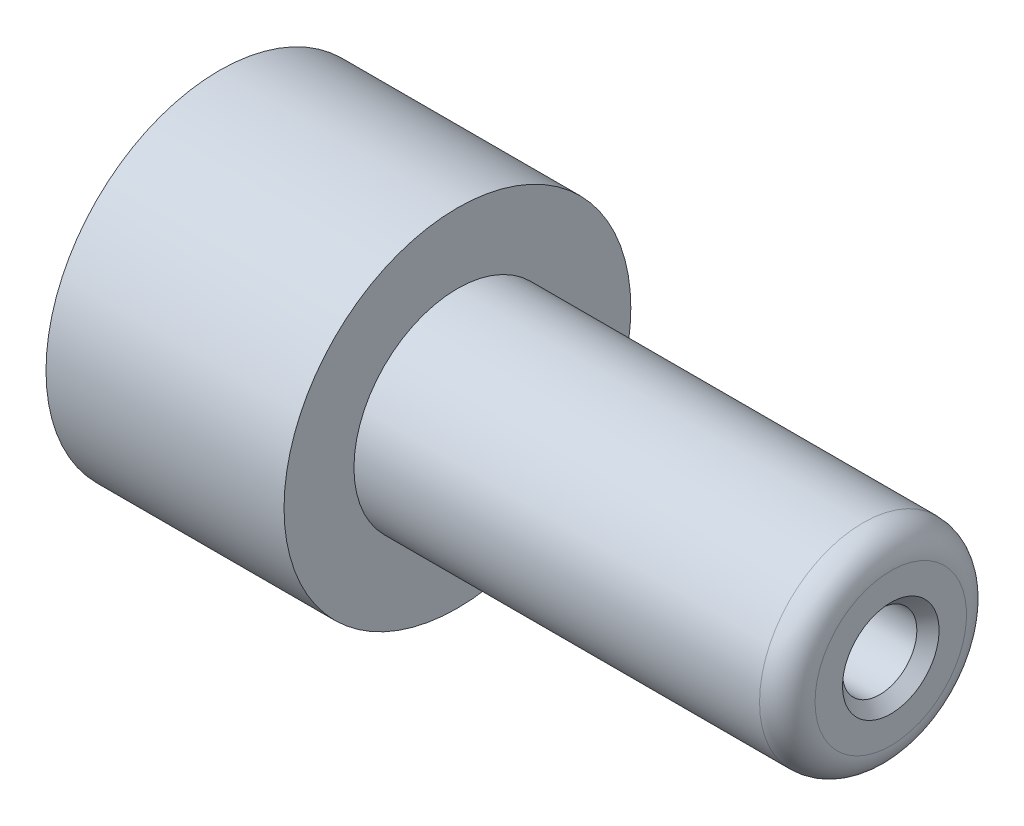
ISO-10303-21;
HEADER;
FILE_DESCRIPTION(('STEP AP214'),'2;1');
FILE_NAME('part.step','',(''),(''),'','','');
FILE_SCHEMA(('AUTOMOTIVE_DESIGN { 1 0 10303 214 1 1 1 1 }'));
ENDSEC;
DATA;
#1=APPLICATION_CONTEXT('core data for automotive mechanical design processes');
#2=APPLICATION_PROTOCOL_DEFINITION('international standard','automotive_design',2000,#1);
#3=PRODUCT_CONTEXT('',#1,'mechanical');
#4=PRODUCT('Part','Part','',(#3));
#5=PRODUCT_RELATED_PRODUCT_CATEGORY('part','',(#4));
#6=PRODUCT_DEFINITION_FORMATION('','',#4);
#7=PRODUCT_DEFINITION_CONTEXT('part definition',#1,'design');
#8=PRODUCT_DEFINITION('design','',#6,#7);
#9=PRODUCT_DEFINITION_SHAPE('','',#8);
#10=(LENGTH_UNIT() NAMED_UNIT(*) SI_UNIT(.MILLI.,.METRE.));
#11=(NAMED_UNIT(*) PLANE_ANGLE_UNIT() SI_UNIT($,.RADIAN.));
#12=(NAMED_UNIT(*) SI_UNIT($,.STERADIAN.) SOLID_ANGLE_UNIT());
#13=UNCERTAINTY_MEASURE_WITH_UNIT(LENGTH_MEASURE(1.E-05),#10,'distance_accuracy_value','');
#14=(GEOMETRIC_REPRESENTATION_CONTEXT(3) GLOBAL_UNCERTAINTY_ASSIGNED_CONTEXT((#13)) GLOBAL_UNIT_ASSIGNED_CONTEXT((#10,
#11,#12)) REPRESENTATION_CONTEXT('',''));
#15=CARTESIAN_POINT('',(0.,0.,0.));
#16=DIRECTION('',(0.,0.,1.));
#17=DIRECTION('',(1.,0.,0.));
#18=AXIS2_PLACEMENT_3D('',#15,#16,#17);
#19=CARTESIAN_POINT('',(0.,0.,0.));
#20=DIRECTION('',(-1.,0.,0.));
#21=DIRECTION('',(0.,0.,1.));
#22=AXIS2_PLACEMENT_3D('',#19,#20,#21);
#23=CYLINDRICAL_SURFACE('',#22,3.5687);
#24=CARTESIAN_POINT('',(24.4856,0.,0.));
#25=DIRECTION('',(-1.,0.,0.));
#26=DIRECTION('',(0.,0.,1.));
#27=AXIS2_PLACEMENT_3D('',#24,#25,#26);
#28=CIRCLE('',#27,3.5687);
#29=CARTESIAN_POINT('',(24.4856,0.,3.5687));
#30=VERTEX_POINT('',#29);
#31=EDGE_CURVE('E44',#30,#30,#28,.T.);
#32=ORIENTED_EDGE('',*,*,#31,.F.);
#33=EDGE_LOOP('',(#32));
#34=FACE_BOUND('',#33,.T.);
#35=CARTESIAN_POINT('',(0.,0.,0.));
#36=DIRECTION('',(-1.,0.,0.));
#37=DIRECTION('',(0.,0.,1.));
#38=AXIS2_PLACEMENT_3D('',#35,#36,#37);
#39=CIRCLE('',#38,3.5687);
#40=CARTESIAN_POINT('',(0.,0.,3.5687));
#41=VERTEX_POINT('',#40);
#42=EDGE_CURVE('E65',#41,#41,#39,.T.);
#43=ORIENTED_EDGE('',*,*,#42,.T.);
#44=EDGE_LOOP('',(#43));
#45=FACE_BOUND('',#44,.T.);
#46=ADVANCED_FACE('F33',(#34,#45),#23,.F.);
#47=CARTESIAN_POINT('',(24.4856,3.5687,0.));
#48=DIRECTION('',(1.,0.,0.));
#49=DIRECTION('',(0.,0.,-1.));
#50=AXIS2_PLACEMENT_3D('',#47,#48,#49);
#51=PLANE('',#50);
#52=CARTESIAN_POINT('',(24.4856,0.,0.));
#53=DIRECTION('',(1.,0.,0.));
#54=DIRECTION('',(0.,0.,-1.));
#55=AXIS2_PLACEMENT_3D('',#52,#53,#54);
#56=CIRCLE('',#55,1.7018);
#57=CARTESIAN_POINT('',(24.4856,0.,-1.7018));
#58=VERTEX_POINT('',#57);
#59=EDGE_CURVE('E78',#58,#58,#56,.T.);
#60=ORIENTED_EDGE('',*,*,#59,.T.);
#61=EDGE_LOOP('',(#60));
#62=FACE_BOUND('',#61,.T.);
#63=ORIENTED_EDGE('',*,*,#31,.T.);
#64=EDGE_LOOP('',(#63));
#65=FACE_BOUND('',#64,.T.);
#66=ADVANCED_FACE('F84',(#62,#65),#51,.F.);
#67=CARTESIAN_POINT('',(30.734,3.4671,0.));
#68=DIRECTION('',(-1.,0.,0.));
#69=DIRECTION('',(0.,0.,1.));
#70=AXIS2_PLACEMENT_3D('',#67,#68,#69);
#71=PLANE('',#70);
#72=CARTESIAN_POINT('',(30.734,0.,0.));
#73=DIRECTION('',(-1.,0.,0.));
#74=DIRECTION('',(0.,0.,1.));
#75=AXIS2_PLACEMENT_3D('',#72,#73,#74);
#76=CIRCLE('',#75,2.2098);
#77=CARTESIAN_POINT('',(30.734,0.,2.2098));
#78=VERTEX_POINT('',#77);
#79=EDGE_CURVE('E10',#78,#78,#76,.T.);
#80=ORIENTED_EDGE('',*,*,#79,.T.);
#81=EDGE_LOOP('',(#80));
#82=FACE_BOUND('',#81,.T.);
#83=CARTESIAN_POINT('',(30.734,0.,0.));
#84=DIRECTION('',(-1.,0.,0.));
#85=DIRECTION('',(0.,0.,1.));
#86=AXIS2_PLACEMENT_3D('',#83,#84,#85);
#87=CIRCLE('',#86,3.4671);
#88=CARTESIAN_POINT('',(30.734,0.,3.4671));
#89=VERTEX_POINT('',#88);
#90=EDGE_CURVE('E48',#89,#89,#87,.T.);
#91=ORIENTED_EDGE('',*,*,#90,.F.);
#92=EDGE_LOOP('',(#91));
#93=FACE_BOUND('',#92,.T.);
#94=ADVANCED_FACE('F104',(#82,#93),#71,.F.);
#95=CARTESIAN_POINT('',(29.464,0.,0.));
#96=DIRECTION('',(-1.,0.,0.));
#97=DIRECTION('',(0.,0.,1.));
#98=AXIS2_PLACEMENT_3D('',#95,#96,#97);
#99=TOROIDAL_SURFACE('',#98,3.4671,1.27);
#100=CARTESIAN_POINT('',(29.464,0.,0.));
#101=DIRECTION('',(-1.,0.,0.));
#102=DIRECTION('',(0.,0.,1.));
#103=AXIS2_PLACEMENT_3D('',#100,#101,#102);
#104=CIRCLE('',#103,4.7371);
#105=CARTESIAN_POINT('',(29.464,0.,4.7371));
#106=VERTEX_POINT('',#105);
#107=EDGE_CURVE('E53',#106,#106,#104,.T.);
#108=ORIENTED_EDGE('',*,*,#107,.F.);
#109=EDGE_LOOP('',(#108));
#110=FACE_BOUND('',#109,.T.);
#111=ORIENTED_EDGE('',*,*,#90,.T.);
#112=EDGE_LOOP('',(#111));
#113=FACE_BOUND('',#112,.T.);
#114=ADVANCED_FACE('F111',(#110,#113),#99,.T.);
#115=CARTESIAN_POINT('',(0.,0.,0.));
#116=DIRECTION('',(-1.,0.,0.));
#117=DIRECTION('',(0.,0.,1.));
#118=AXIS2_PLACEMENT_3D('',#115,#116,#117);
#119=CYLINDRICAL_SURFACE('',#118,4.7371);
#120=CARTESIAN_POINT('',(10.8966,0.,0.));
#121=DIRECTION('',(-1.,0.,0.));
#122=DIRECTION('',(0.,0.,1.));
#123=AXIS2_PLACEMENT_3D('',#120,#121,#122);
#124=CIRCLE('',#123,4.7371);
#125=CARTESIAN_POINT('',(10.8966,0.,4.7371));
#126=VERTEX_POINT('',#125);
#127=EDGE_CURVE('E56',#126,#126,#124,.T.);
#128=ORIENTED_EDGE('',*,*,#127,.F.);
#129=EDGE_LOOP('',(#128));
#130=FACE_BOUND('',#129,.T.);
#131=ORIENTED_EDGE('',*,*,#107,.T.);
#132=EDGE_LOOP('',(#131));
#133=FACE_BOUND('',#132,.T.);
#134=ADVANCED_FACE('F114',(#130,#133),#119,.T.);
#135=CARTESIAN_POINT('',(10.8966,7.9375,0.));
#136=DIRECTION('',(-1.,0.,0.));
#137=DIRECTION('',(0.,0.,1.));
#138=AXIS2_PLACEMENT_3D('',#135,#136,#137);
#139=PLANE('',#138);
#140=CARTESIAN_POINT('',(10.8966,0.,0.));
#141=DIRECTION('',(-1.,0.,0.));
#142=DIRECTION('',(0.,0.,1.));
#143=AXIS2_PLACEMENT_3D('',#140,#141,#142);
#144=CIRCLE('',#143,7.9375);
#145=CARTESIAN_POINT('',(10.8966,0.,7.9375));
#146=VERTEX_POINT('',#145);
#147=EDGE_CURVE('E59',#146,#146,#144,.T.);
#148=ORIENTED_EDGE('',*,*,#147,.F.);
#149=EDGE_LOOP('',(#148));
#150=FACE_BOUND('',#149,.T.);
#151=ORIENTED_EDGE('',*,*,#127,.T.);
#152=EDGE_LOOP('',(#151));
#153=FACE_BOUND('',#152,.T.);
#154=ADVANCED_FACE('F118',(#150,#153),#139,.F.);
#155=CARTESIAN_POINT('',(0.,0.,0.));
#156=DIRECTION('',(-1.,0.,0.));
#157=DIRECTION('',(0.,0.,1.));
#158=AXIS2_PLACEMENT_3D('',#155,#156,#157);
#159=CYLINDRICAL_SURFACE('',#158,7.9375);
#160=CARTESIAN_POINT('',(0.,0.,0.));
#161=DIRECTION('',(-1.,0.,0.));
#162=DIRECTION('',(0.,0.,1.));
#163=AXIS2_PLACEMENT_3D('',#160,#161,#162);
#164=CIRCLE('',#163,7.9375);
#165=CARTESIAN_POINT('',(0.,0.,7.9375));
#166=VERTEX_POINT('',#165);
#167=EDGE_CURVE('E62',#166,#166,#164,.T.);
#168=ORIENTED_EDGE('',*,*,#167,.F.);
#169=EDGE_LOOP('',(#168));
#170=FACE_BOUND('',#169,.T.);
#171=ORIENTED_EDGE('',*,*,#147,.T.);
#172=EDGE_LOOP('',(#171));
#173=FACE_BOUND('',#172,.T.);
#174=ADVANCED_FACE('F122',(#170,#173),#159,.T.);
#175=CARTESIAN_POINT('',(0.,3.5687,0.));
#176=DIRECTION('',(1.,0.,0.));
#177=DIRECTION('',(0.,0.,-1.));
#178=AXIS2_PLACEMENT_3D('',#175,#176,#177);
#179=PLANE('',#178);
#180=CARTESIAN_POINT('',(0.,0.,5.5499));
#181=DIRECTION('',(-1.,0.,0.));
#182=DIRECTION('',(0.,0.,-1.));
#183=AXIS2_PLACEMENT_3D('',#180,#181,#182);
#184=CIRCLE('',#183,1.1811);
#185=CARTESIAN_POINT('',(0.,0.,4.3688));
#186=VERTEX_POINT('',#185);
#187=EDGE_CURVE('E75',#186,#186,#184,.T.);
#188=ORIENTED_EDGE('',*,*,#187,.F.);
#189=EDGE_LOOP('',(#188));
#190=FACE_BOUND('',#189,.T.);
#191=CARTESIAN_POINT('',(0.,0.,-5.5499));
#192=DIRECTION('',(-1.,0.,0.));
#193=DIRECTION('',(0.,0.,1.));
#194=AXIS2_PLACEMENT_3D('',#191,#192,#193);
#195=CIRCLE('',#194,1.1811);
#196=CARTESIAN_POINT('',(0.,0.,-4.3688));
#197=VERTEX_POINT('',#196);
#198=EDGE_CURVE('E69',#197,#197,#195,.T.);
#199=ORIENTED_EDGE('',*,*,#198,.F.);
#200=EDGE_LOOP('',(#199));
#201=FACE_BOUND('',#200,.T.);
#202=ORIENTED_EDGE('',*,*,#42,.F.);
#203=EDGE_LOOP('',(#202));
#204=FACE_BOUND('',#203,.T.);
#205=ORIENTED_EDGE('',*,*,#167,.T.);
#206=EDGE_LOOP('',(#205));
#207=FACE_BOUND('',#206,.T.);
#208=ADVANCED_FACE('F126',(#190,#201,#204,#207),#179,.F.);
#209=CARTESIAN_POINT('',(2.3622,0.,-5.5499));
#210=DIRECTION('',(-1.,0.,0.));
#211=DIRECTION('',(0.,0.,1.));
#212=AXIS2_PLACEMENT_3D('',#209,#210,#211);
#213=CYLINDRICAL_SURFACE('',#212,1.1811);
#214=CARTESIAN_POINT('',(2.3622,0.,-5.5499));
#215=DIRECTION('',(-1.,0.,0.));
#216=DIRECTION('',(0.,0.,1.));
#217=AXIS2_PLACEMENT_3D('',#214,#215,#216);
#218=CIRCLE('',#217,1.1811);
#219=CARTESIAN_POINT('',(2.3622,0.,-4.3688));
#220=VERTEX_POINT('',#219);
#221=EDGE_CURVE('E68',#220,#220,#218,.T.);
#222=ORIENTED_EDGE('',*,*,#221,.F.);
#223=EDGE_LOOP('',(#222));
#224=FACE_BOUND('',#223,.T.);
#225=ORIENTED_EDGE('',*,*,#198,.T.);
#226=EDGE_LOOP('',(#225));
#227=FACE_BOUND('',#226,.T.);
#228=ADVANCED_FACE('F130',(#224,#227),#213,.F.);
#229=CARTESIAN_POINT('',(2.3622,0.,-5.5499));
#230=DIRECTION('',(-1.,0.,0.));
#231=DIRECTION('',(0.,0.,1.));
#232=AXIS2_PLACEMENT_3D('',#229,#230,#231);
#233=PLANE('',#232);
#234=ORIENTED_EDGE('',*,*,#221,.T.);
#235=EDGE_LOOP('',(#234));
#236=FACE_BOUND('',#235,.T.);
#237=ADVANCED_FACE('F134',(#236),#233,.T.);
#238=CARTESIAN_POINT('',(2.3622,0.,5.5499));
#239=DIRECTION('',(-1.,0.,0.));
#240=DIRECTION('',(0.,0.,1.));
#241=AXIS2_PLACEMENT_3D('',#238,#239,#240);
#242=CYLINDRICAL_SURFACE('',#241,1.1811);
#243=CARTESIAN_POINT('',(2.3622,0.,5.5499));
#244=DIRECTION('',(-1.,0.,0.));
#245=DIRECTION('',(0.,0.,-1.));
#246=AXIS2_PLACEMENT_3D('',#243,#244,#245);
#247=CIRCLE('',#246,1.1811);
#248=CARTESIAN_POINT('',(2.3622,0.,4.3688));
#249=VERTEX_POINT('',#248);
#250=EDGE_CURVE('E72',#249,#249,#247,.T.);
#251=ORIENTED_EDGE('',*,*,#250,.F.);
#252=EDGE_LOOP('',(#251));
#253=FACE_BOUND('',#252,.T.);
#254=ORIENTED_EDGE('',*,*,#187,.T.);
#255=EDGE_LOOP('',(#254));
#256=FACE_BOUND('',#255,.T.);
#257=ADVANCED_FACE('F96',(#253,#256),#242,.F.);
#258=CARTESIAN_POINT('',(2.3622,0.,5.5499));
#259=DIRECTION('',(1.,0.,0.));
#260=DIRECTION('',(0.,0.,-1.));
#261=AXIS2_PLACEMENT_3D('',#258,#259,#260);
#262=PLANE('',#261);
#263=ORIENTED_EDGE('',*,*,#250,.T.);
#264=EDGE_LOOP('',(#263));
#265=FACE_BOUND('',#264,.T.);
#266=ADVANCED_FACE('F89',(#265),#262,.F.);
#267=CARTESIAN_POINT('',(0.,0.,0.));
#268=DIRECTION('',(1.,0.,0.));
#269=DIRECTION('',(0.,0.,-1.));
#270=AXIS2_PLACEMENT_3D('',#267,#268,#269);
#271=CYLINDRICAL_SURFACE('',#270,1.7018);
#272=CARTESIAN_POINT('',(30.226,0.,0.));
#273=DIRECTION('',(-1.,0.,0.));
#274=DIRECTION('',(0.,0.,1.));
#275=AXIS2_PLACEMENT_3D('',#272,#273,#274);
#276=CIRCLE('',#275,1.7018);
#277=CARTESIAN_POINT('',(30.226,0.,1.7018));
#278=VERTEX_POINT('',#277);
#279=EDGE_CURVE('E40',#278,#278,#276,.F.);
#280=ORIENTED_EDGE('',*,*,#279,.T.);
#281=EDGE_LOOP('',(#280));
#282=FACE_BOUND('',#281,.T.);
#283=ORIENTED_EDGE('',*,*,#59,.F.);
#284=EDGE_LOOP('',(#283));
#285=FACE_BOUND('',#284,.T.);
#286=ADVANCED_FACE('F87',(#282,#285),#271,.F.);
#287=CARTESIAN_POINT('',(30.226,0.,0.));
#288=DIRECTION('',(1.,0.,0.));
#289=DIRECTION('',(0.,0.,-1.));
#290=AXIS2_PLACEMENT_3D('',#287,#288,#289);
#291=CONICAL_SURFACE('',#290,1.7018,0.785398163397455);
#292=ORIENTED_EDGE('',*,*,#79,.F.);
#293=EDGE_LOOP('',(#292));
#294=FACE_BOUND('',#293,.T.);
#295=ORIENTED_EDGE('',*,*,#279,.F.);
#296=EDGE_LOOP('',(#295));
#297=FACE_BOUND('',#296,.T.);
#298=ADVANCED_FACE('F35',(#294,#297),#291,.F.);
#299=CLOSED_SHELL('',(#46,#66,#94,#114,#134,#154,#174,#208,#228,#237,#257,#266,#286,#298));
#300=MANIFOLD_SOLID_BREP('B2',#299);
#301=ADVANCED_BREP_SHAPE_REPRESENTATION('',(#18,#300),#14);
#302=SHAPE_DEFINITION_REPRESENTATION(#9,#301);
ENDSEC;
END-ISO-10303-21;
